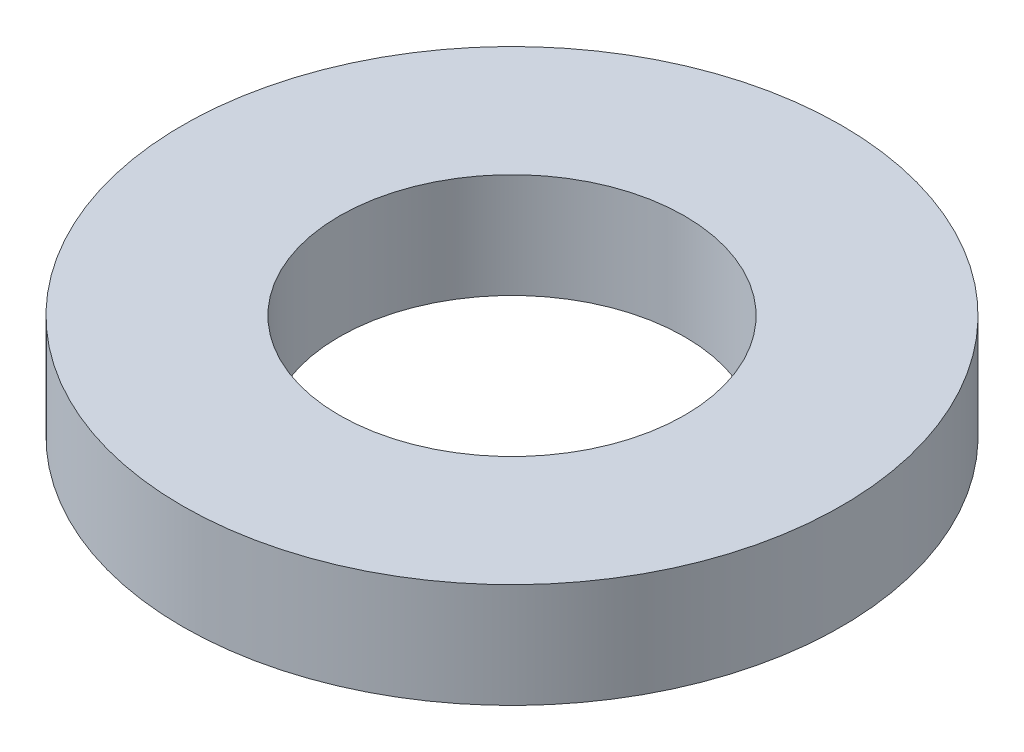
from build123d import *

# Parameters (mm, degrees)
SKETCH1_R           = 31.5
SKETCH1_R_2         = 16.5
BOSS_EXTRUDE1_DEPTH = 10


with BuildPart() as part:
    # Sketch1 → Boss-Extrude1 (new body)
    with BuildSketch(Plane(origin=(0, 0, 0), x_dir=(1, 0, 0), z_dir=(0, 1, 0))):
        with Locations(Location((0, 0, 0), (0, 0, 270))):
            Circle(SKETCH1_R)
        with Locations(Location((0, 0, 0), (0, 0, 270))):
            Circle(SKETCH1_R_2, mode=Mode.SUBTRACT)
    extrude(amount=BOSS_EXTRUDE1_DEPTH)


solid = part.part
